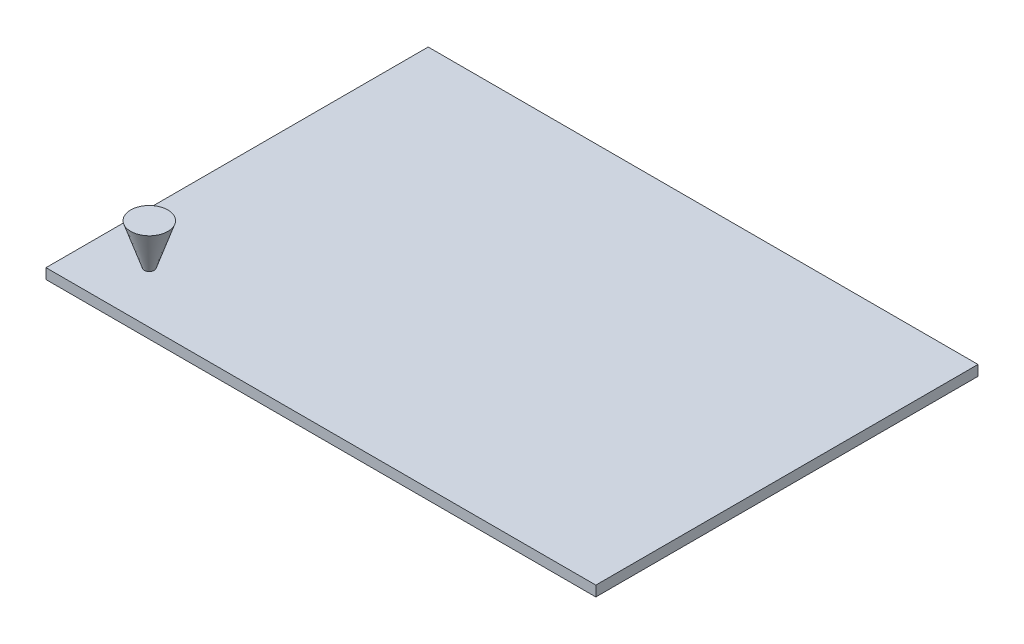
ISO-10303-21;
HEADER;
FILE_DESCRIPTION(('STEP AP214'),'2;1');
FILE_NAME('part.step','',(''),(''),'','','');
FILE_SCHEMA(('AUTOMOTIVE_DESIGN { 1 0 10303 214 1 1 1 1 }'));
ENDSEC;
DATA;
#1=APPLICATION_CONTEXT('core data for automotive mechanical design processes');
#2=APPLICATION_PROTOCOL_DEFINITION('international standard','automotive_design',2000,#1);
#3=PRODUCT_CONTEXT('',#1,'mechanical');
#4=PRODUCT('Part','Part','',(#3));
#5=PRODUCT_RELATED_PRODUCT_CATEGORY('part','',(#4));
#6=PRODUCT_DEFINITION_FORMATION('','',#4);
#7=PRODUCT_DEFINITION_CONTEXT('part definition',#1,'design');
#8=PRODUCT_DEFINITION('design','',#6,#7);
#9=PRODUCT_DEFINITION_SHAPE('','',#8);
#10=(LENGTH_UNIT() NAMED_UNIT(*) SI_UNIT(.MILLI.,.METRE.));
#11=(NAMED_UNIT(*) PLANE_ANGLE_UNIT() SI_UNIT($,.RADIAN.));
#12=(NAMED_UNIT(*) SI_UNIT($,.STERADIAN.) SOLID_ANGLE_UNIT());
#13=UNCERTAINTY_MEASURE_WITH_UNIT(LENGTH_MEASURE(1.E-05),#10,'distance_accuracy_value','');
#14=(GEOMETRIC_REPRESENTATION_CONTEXT(3) GLOBAL_UNCERTAINTY_ASSIGNED_CONTEXT((#13)) GLOBAL_UNIT_ASSIGNED_CONTEXT((#10,
#11,#12)) REPRESENTATION_CONTEXT('',''));
#15=CARTESIAN_POINT('',(0.,0.,0.));
#16=DIRECTION('',(0.,0.,1.));
#17=DIRECTION('',(1.,0.,0.));
#18=AXIS2_PLACEMENT_3D('',#15,#16,#17);
#19=CARTESIAN_POINT('',(0.,12.5487447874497,0.));
#20=DIRECTION('',(0.,1.,0.));
#21=DIRECTION('',(0.,0.,1.));
#22=AXIS2_PLACEMENT_3D('',#19,#20,#21);
#23=PLANE('',#22);
#24=CARTESIAN_POINT('',(0.,12.5487447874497,0.));
#25=DIRECTION('',(0.,-1.,0.));
#26=DIRECTION('',(0.,0.,-1.));
#27=AXIS2_PLACEMENT_3D('',#24,#25,#26);
#28=CIRCLE('',#27,4.56856309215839);
#29=CARTESIAN_POINT('',(0.,12.5487447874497,4.56856309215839));
#30=VERTEX_POINT('',#29);
#31=EDGE_CURVE('E11',#30,#30,#28,.T.);
#32=ORIENTED_EDGE('',*,*,#31,.F.);
#33=EDGE_LOOP('',(#32));
#34=FACE_BOUND('',#33,.T.);
#35=ADVANCED_FACE('F45',(#34),#23,.T.);
#36=CARTESIAN_POINT('',(0.,1.74946044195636,0.));
#37=DIRECTION('',(0.,1.,0.));
#38=DIRECTION('',(0.,0.,1.));
#39=AXIS2_PLACEMENT_3D('',#36,#37,#38);
#40=CONICAL_SURFACE('',#39,0.936430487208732,0.32444589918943);
#41=CARTESIAN_POINT('',(0.,1.74946044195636,0.));
#42=DIRECTION('',(0.,-1.,0.));
#43=DIRECTION('',(0.,0.,-1.));
#44=AXIS2_PLACEMENT_3D('',#41,#42,#43);
#45=CIRCLE('',#44,0.936430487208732);
#46=CARTESIAN_POINT('',(0.,1.74946044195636,0.936430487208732));
#47=VERTEX_POINT('',#46);
#48=EDGE_CURVE('E51',#47,#47,#45,.T.);
#49=CARTESIAN_POINT('',(0.,12.5487447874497,4.56856309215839));
#50=CARTESIAN_POINT('',(0.,12.4362522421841,4.53072837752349));
#51=CARTESIAN_POINT('',(0.,12.3237596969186,4.4928936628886));
#52=CARTESIAN_POINT('',(0.,12.0987746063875,4.41722423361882));
#53=CARTESIAN_POINT('',(0.,11.9862820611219,4.37938951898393));
#54=CARTESIAN_POINT('',(0.,11.7612969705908,4.30372008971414));
#55=CARTESIAN_POINT('',(0.,11.6488044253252,4.26588537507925));
#56=CARTESIAN_POINT('',(0.,11.4238193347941,4.19021594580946));
#57=CARTESIAN_POINT('',(0.,11.3113267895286,4.15238123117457));
#58=CARTESIAN_POINT('',(0.,11.0863416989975,4.07671180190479));
#59=CARTESIAN_POINT('',(0.,10.9738491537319,4.0388770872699));
#60=CARTESIAN_POINT('',(0.,10.7488640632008,3.96320765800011));
#61=CARTESIAN_POINT('',(0.,10.6363715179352,3.92537294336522));
#62=CARTESIAN_POINT('',(0.,10.4113864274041,3.84970351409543));
#63=CARTESIAN_POINT('',(0.,10.2988938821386,3.81186879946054));
#64=CARTESIAN_POINT('',(0.,10.0739087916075,3.73619937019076));
#65=CARTESIAN_POINT('',(0.,9.96141624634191,3.69836465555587));
#66=CARTESIAN_POINT('',(0.,9.7364311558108,3.62269522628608));
#67=CARTESIAN_POINT('',(0.,9.62393861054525,3.58486051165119));
#68=CARTESIAN_POINT('',(0.,9.39895352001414,3.5091910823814));
#69=CARTESIAN_POINT('',(0.,9.28646097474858,3.47135636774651));
#70=CARTESIAN_POINT('',(0.,9.06147588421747,3.39568693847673));
#71=CARTESIAN_POINT('',(0.,8.94898333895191,3.35785222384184));
#72=CARTESIAN_POINT('',(0.,8.7239982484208,3.28218279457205));
#73=CARTESIAN_POINT('',(0.,8.61150570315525,3.24434807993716));
#74=CARTESIAN_POINT('',(0.,8.38652061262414,3.16867865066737));
#75=CARTESIAN_POINT('',(0.,8.27402806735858,3.13084393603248));
#76=CARTESIAN_POINT('',(0.,8.04904297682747,3.0551745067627));
#77=CARTESIAN_POINT('',(0.,7.93655043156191,3.01733979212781));
#78=CARTESIAN_POINT('',(0.,7.7115653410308,2.94167036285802));
#79=CARTESIAN_POINT('',(0.,7.59907279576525,2.90383564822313));
#80=CARTESIAN_POINT('',(0.,7.37408770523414,2.82816621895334));
#81=CARTESIAN_POINT('',(0.,7.26159515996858,2.79033150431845));
#82=CARTESIAN_POINT('',(0.,7.03661006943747,2.71466207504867));
#83=CARTESIAN_POINT('',(0.,6.92411752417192,2.67682736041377));
#84=CARTESIAN_POINT('',(0.,6.6991324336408,2.60115793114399));
#85=CARTESIAN_POINT('',(0.,6.58663988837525,2.5633232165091));
#86=CARTESIAN_POINT('',(0.,6.36165479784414,2.48765378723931));
#87=CARTESIAN_POINT('',(0.,6.24916225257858,2.44981907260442));
#88=CARTESIAN_POINT('',(0.,6.02417716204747,2.37414964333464));
#89=CARTESIAN_POINT('',(0.,5.91168461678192,2.33631492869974));
#90=CARTESIAN_POINT('',(0.,5.68669952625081,2.26064549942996));
#91=CARTESIAN_POINT('',(0.,5.57420698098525,2.22281078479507));
#92=CARTESIAN_POINT('',(0.,5.34922189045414,2.14714135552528));
#93=CARTESIAN_POINT('',(0.,5.23672934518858,2.10930664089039));
#94=CARTESIAN_POINT('',(0.,5.01174425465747,2.03363721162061));
#95=CARTESIAN_POINT('',(0.,4.89925170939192,1.99580249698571));
#96=CARTESIAN_POINT('',(0.,4.67426661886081,1.92013306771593));
#97=CARTESIAN_POINT('',(0.,4.56177407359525,1.88229835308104));
#98=CARTESIAN_POINT('',(0.,4.33678898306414,1.80662892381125));
#99=CARTESIAN_POINT('',(0.,4.22429643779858,1.76879420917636));
#100=CARTESIAN_POINT('',(0.,3.99931134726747,1.69312477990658));
#101=CARTESIAN_POINT('',(0.,3.88681880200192,1.65529006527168));
#102=CARTESIAN_POINT('',(0.,3.66183371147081,1.5796206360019));
#103=CARTESIAN_POINT('',(0.,3.54934116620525,1.54178592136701));
#104=CARTESIAN_POINT('',(0.,3.32435607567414,1.46611649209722));
#105=CARTESIAN_POINT('',(0.,3.21186353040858,1.42828177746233));
#106=CARTESIAN_POINT('',(0.,2.98687843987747,1.35261234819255));
#107=CARTESIAN_POINT('',(0.,2.87438589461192,1.31477763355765));
#108=CARTESIAN_POINT('',(0.,2.64940080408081,1.23910820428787));
#109=CARTESIAN_POINT('',(0.,2.53690825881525,1.20127348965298));
#110=CARTESIAN_POINT('',(0.,2.31192316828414,1.12560406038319));
#111=CARTESIAN_POINT('',(0.,2.19943062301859,1.0877693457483));
#112=CARTESIAN_POINT('',(0.,1.97444553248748,1.01209991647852));
#113=CARTESIAN_POINT('',(0.,1.86195298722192,0.974265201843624));
#114=CARTESIAN_POINT('',(0.,1.74946044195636,0.936430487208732));
#115=B_SPLINE_CURVE_WITH_KNOTS('',3,(#49,#50,#51,#52,#53,#54,#55,#56,#57,#58,#59,#60,#61,#62,
#63,#64,#65,#66,#67,#68,#69,#70,#71,#72,#73,#74,#75,#76,#77,#78,#79,#80,#81,#82,#83,#84,#85,#86,
#87,#88,#89,#90,#91,#92,#93,#94,#95,#96,#97,#98,#99,#100,#101,#102,#103,#104,#105,#106,#107,
#108,#109,#110,#111,#112,#113,#114),.UNSPECIFIED.,.F.,.F.,(4,2,2,2,2,2,2,2,2,2,2,2,2,2,2,2,2,2,
2,2,2,2,2,2,2,2,2,2,2,2,2,2,4),(0.,0.356053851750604,0.712107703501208,1.06816155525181,
1.42421540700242,1.78026925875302,2.13632311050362,2.49237696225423,2.84843081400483,
3.20448466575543,3.56053851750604,3.91659236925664,4.27264622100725,4.62870007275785,
4.98475392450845,5.34080777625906,5.69686162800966,6.05291547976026,6.40896933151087,
6.76502318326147,7.12107703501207,7.47713088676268,7.83318473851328,8.18923859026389,
8.54529244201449,8.90134629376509,9.2574001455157,9.6134539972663,9.96950784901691,
10.3255617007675,10.6816155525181,11.0376694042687,11.3937232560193),.UNSPECIFIED.);
#116=EDGE_CURVE('BSEAM59',#30,#47,#115,.T.);
#117=ORIENTED_EDGE('',*,*,#31,.T.);
#118=ORIENTED_EDGE('',*,*,#48,.F.);
#119=ORIENTED_EDGE('',*,*,#116,.T.);
#120=ORIENTED_EDGE('',*,*,#116,.F.);
#121=EDGE_LOOP('',(#117,#119,#118,#120));
#122=FACE_BOUND('',#121,.T.);
#123=ADVANCED_FACE('F59',(#122),#40,.T.);
#124=CARTESIAN_POINT('',(0.936430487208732,1.74946044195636,0.));
#125=DIRECTION('',(0.,-1.,0.));
#126=DIRECTION('',(0.,0.,-1.));
#127=AXIS2_PLACEMENT_3D('',#124,#125,#126);
#128=PLANE('',#127);
#129=ORIENTED_EDGE('',*,*,#48,.T.);
#130=EDGE_LOOP('',(#129));
#131=FACE_BOUND('',#130,.T.);
#132=ADVANCED_FACE('F57',(#131),#128,.T.);
#133=CLOSED_SHELL('',(#35,#123,#132));
#134=MANIFOLD_SOLID_BREP('B2',#133);
#135=CARTESIAN_POINT('',(-12.7,2.54,-81.2798054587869));
#136=DIRECTION('',(1.,0.,0.));
#137=DIRECTION('',(0.,0.,-1.));
#138=AXIS2_PLACEMENT_3D('',#135,#136,#137);
#139=PLANE('',#138);
#140=DIRECTION('',(0.,0.,1.));
#141=VECTOR('',#140,1.);
#142=CARTESIAN_POINT('',(-12.7,0.,-81.2798054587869));
#143=LINE('',#142,#141);
#144=CARTESIAN_POINT('',(-12.7,0.,-81.2798054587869));
#145=VERTEX_POINT('',#144);
#146=CARTESIAN_POINT('',(-12.7,0.,12.7));
#147=VERTEX_POINT('',#146);
#148=EDGE_CURVE('E149',#145,#147,#143,.T.);
#149=ORIENTED_EDGE('',*,*,#148,.T.);
#150=DIRECTION('',(0.,-1.,0.));
#151=VECTOR('',#150,1.);
#152=CARTESIAN_POINT('',(-12.7,2.54,12.7));
#153=LINE('',#152,#151);
#154=CARTESIAN_POINT('',(-12.7,2.54,12.7));
#155=VERTEX_POINT('',#154);
#156=EDGE_CURVE('E43',#155,#147,#153,.T.);
#157=ORIENTED_EDGE('',*,*,#156,.F.);
#158=DIRECTION('',(0.,0.,1.));
#159=VECTOR('',#158,1.);
#160=CARTESIAN_POINT('',(-12.7,2.54,-81.2798054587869));
#161=LINE('',#160,#159);
#162=CARTESIAN_POINT('',(-12.7,2.54,-81.2798054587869));
#163=VERTEX_POINT('',#162);
#164=EDGE_CURVE('E137',#163,#155,#161,.T.);
#165=ORIENTED_EDGE('',*,*,#164,.F.);
#166=DIRECTION('',(0.,-1.,0.));
#167=VECTOR('',#166,1.);
#168=CARTESIAN_POINT('',(-12.7,2.54,-81.2798054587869));
#169=LINE('',#168,#167);
#170=EDGE_CURVE('E145',#163,#145,#169,.T.);
#171=ORIENTED_EDGE('',*,*,#170,.T.);
#172=EDGE_LOOP('',(#149,#157,#165,#171));
#173=FACE_BOUND('',#172,.T.);
#174=ADVANCED_FACE('F86',(#173),#139,.F.);
#175=CARTESIAN_POINT('',(-12.7,2.54,12.7));
#176=DIRECTION('',(0.,0.,-1.));
#177=DIRECTION('',(-1.,0.,0.));
#178=AXIS2_PLACEMENT_3D('',#175,#176,#177);
#179=PLANE('',#178);
#180=DIRECTION('',(1.,0.,0.));
#181=VECTOR('',#180,1.);
#182=CARTESIAN_POINT('',(-12.7,0.,12.7));
#183=LINE('',#182,#181);
#184=CARTESIAN_POINT('',(122.503541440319,0.,12.7));
#185=VERTEX_POINT('',#184);
#186=EDGE_CURVE('E141',#147,#185,#183,.T.);
#187=ORIENTED_EDGE('',*,*,#186,.T.);
#188=DIRECTION('',(0.,-1.,0.));
#189=VECTOR('',#188,1.);
#190=CARTESIAN_POINT('',(122.503541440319,2.54,12.7));
#191=LINE('',#190,#189);
#192=CARTESIAN_POINT('',(122.503541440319,2.54,12.7));
#193=VERTEX_POINT('',#192);
#194=EDGE_CURVE('E94',#193,#185,#191,.T.);
#195=ORIENTED_EDGE('',*,*,#194,.F.);
#196=DIRECTION('',(1.,0.,0.));
#197=VECTOR('',#196,1.);
#198=CARTESIAN_POINT('',(-12.7,2.54,12.7));
#199=LINE('',#198,#197);
#200=EDGE_CURVE('E132',#155,#193,#199,.T.);
#201=ORIENTED_EDGE('',*,*,#200,.F.);
#202=ORIENTED_EDGE('',*,*,#156,.T.);
#203=EDGE_LOOP('',(#187,#195,#201,#202));
#204=FACE_BOUND('',#203,.T.);
#205=ADVANCED_FACE('F140',(#204),#179,.F.);
#206=CARTESIAN_POINT('',(122.503541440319,2.54,-81.2798054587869));
#207=DIRECTION('',(-1.,0.,0.));
#208=DIRECTION('',(0.,0.,1.));
#209=AXIS2_PLACEMENT_3D('',#206,#207,#208);
#210=PLANE('',#209);
#211=DIRECTION('',(0.,0.,-1.));
#212=VECTOR('',#211,1.);
#213=CARTESIAN_POINT('',(122.503541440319,0.,-81.2798054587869));
#214=LINE('',#213,#212);
#215=CARTESIAN_POINT('',(122.503541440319,0.,-81.2798054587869));
#216=VERTEX_POINT('',#215);
#217=EDGE_CURVE('E119',#185,#216,#214,.T.);
#218=ORIENTED_EDGE('',*,*,#217,.T.);
#219=DIRECTION('',(0.,-1.,0.));
#220=VECTOR('',#219,1.);
#221=CARTESIAN_POINT('',(122.503541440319,2.54,-81.2798054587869));
#222=LINE('',#221,#220);
#223=CARTESIAN_POINT('',(122.503541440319,2.54,-81.2798054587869));
#224=VERTEX_POINT('',#223);
#225=EDGE_CURVE('E142',#224,#216,#222,.T.);
#226=ORIENTED_EDGE('',*,*,#225,.F.);
#227=DIRECTION('',(0.,0.,-1.));
#228=VECTOR('',#227,1.);
#229=CARTESIAN_POINT('',(122.503541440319,2.54,-81.2798054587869));
#230=LINE('',#229,#228);
#231=EDGE_CURVE('E135',#193,#224,#230,.T.);
#232=ORIENTED_EDGE('',*,*,#231,.F.);
#233=ORIENTED_EDGE('',*,*,#194,.T.);
#234=EDGE_LOOP('',(#218,#226,#232,#233));
#235=FACE_BOUND('',#234,.T.);
#236=ADVANCED_FACE('F143',(#235),#210,.F.);
#237=CARTESIAN_POINT('',(-12.7,2.54,-81.2798054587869));
#238=DIRECTION('',(0.,0.,1.));
#239=DIRECTION('',(1.,0.,0.));
#240=AXIS2_PLACEMENT_3D('',#237,#238,#239);
#241=PLANE('',#240);
#242=DIRECTION('',(-1.,0.,0.));
#243=VECTOR('',#242,1.);
#244=CARTESIAN_POINT('',(-12.7,0.,-81.2798054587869));
#245=LINE('',#244,#243);
#246=EDGE_CURVE('E125',#216,#145,#245,.T.);
#247=ORIENTED_EDGE('',*,*,#246,.T.);
#248=ORIENTED_EDGE('',*,*,#170,.F.);
#249=DIRECTION('',(-1.,0.,0.));
#250=VECTOR('',#249,1.);
#251=CARTESIAN_POINT('',(-12.7,2.54,-81.2798054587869));
#252=LINE('',#251,#250);
#253=EDGE_CURVE('E102',#224,#163,#252,.T.);
#254=ORIENTED_EDGE('',*,*,#253,.F.);
#255=ORIENTED_EDGE('',*,*,#225,.T.);
#256=EDGE_LOOP('',(#247,#248,#254,#255));
#257=FACE_BOUND('',#256,.T.);
#258=ADVANCED_FACE('F156',(#257),#241,.F.);
#259=CARTESIAN_POINT('',(-12.7,2.54,12.7));
#260=DIRECTION('',(0.,1.,0.));
#261=DIRECTION('',(0.,0.,1.));
#262=AXIS2_PLACEMENT_3D('',#259,#260,#261);
#263=PLANE('',#262);
#264=ORIENTED_EDGE('',*,*,#164,.T.);
#265=ORIENTED_EDGE('',*,*,#200,.T.);
#266=ORIENTED_EDGE('',*,*,#231,.T.);
#267=ORIENTED_EDGE('',*,*,#253,.T.);
#268=EDGE_LOOP('',(#264,#265,#266,#267));
#269=FACE_BOUND('',#268,.T.);
#270=ADVANCED_FACE('F133',(#269),#263,.T.);
#271=CARTESIAN_POINT('',(-12.7,0.,12.7));
#272=DIRECTION('',(0.,1.,0.));
#273=DIRECTION('',(0.,0.,1.));
#274=AXIS2_PLACEMENT_3D('',#271,#272,#273);
#275=PLANE('',#274);
#276=ORIENTED_EDGE('',*,*,#148,.F.);
#277=ORIENTED_EDGE('',*,*,#246,.F.);
#278=ORIENTED_EDGE('',*,*,#217,.F.);
#279=ORIENTED_EDGE('',*,*,#186,.F.);
#280=EDGE_LOOP('',(#276,#277,#278,#279));
#281=FACE_BOUND('',#280,.T.);
#282=ADVANCED_FACE('F159',(#281),#275,.F.);
#283=CLOSED_SHELL('',(#174,#205,#236,#258,#270,#282));
#284=MANIFOLD_SOLID_BREP('B6',#283);
#285=ADVANCED_BREP_SHAPE_REPRESENTATION('',(#18,#134,#284),#14);
#286=SHAPE_DEFINITION_REPRESENTATION(#9,#285);
ENDSEC;
END-ISO-10303-21;
